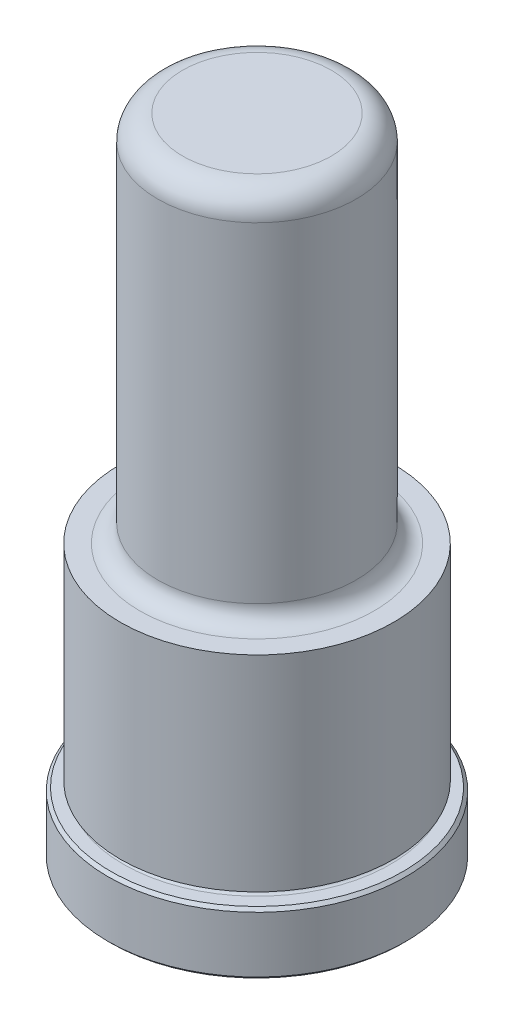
ISO-10303-21;
HEADER;
FILE_DESCRIPTION(('STEP AP214'),'2;1');
FILE_NAME('part.step','',(''),(''),'','','');
FILE_SCHEMA(('AUTOMOTIVE_DESIGN { 1 0 10303 214 1 1 1 1 }'));
ENDSEC;
DATA;
#1=APPLICATION_CONTEXT('core data for automotive mechanical design processes');
#2=APPLICATION_PROTOCOL_DEFINITION('international standard','automotive_design',2000,#1);
#3=PRODUCT_CONTEXT('',#1,'mechanical');
#4=PRODUCT('Part','Part','',(#3));
#5=PRODUCT_RELATED_PRODUCT_CATEGORY('part','',(#4));
#6=PRODUCT_DEFINITION_FORMATION('','',#4);
#7=PRODUCT_DEFINITION_CONTEXT('part definition',#1,'design');
#8=PRODUCT_DEFINITION('design','',#6,#7);
#9=PRODUCT_DEFINITION_SHAPE('','',#8);
#10=(LENGTH_UNIT() NAMED_UNIT(*) SI_UNIT(.MILLI.,.METRE.));
#11=(NAMED_UNIT(*) PLANE_ANGLE_UNIT() SI_UNIT($,.RADIAN.));
#12=(NAMED_UNIT(*) SI_UNIT($,.STERADIAN.) SOLID_ANGLE_UNIT());
#13=UNCERTAINTY_MEASURE_WITH_UNIT(LENGTH_MEASURE(1.E-05),#10,'distance_accuracy_value','');
#14=(GEOMETRIC_REPRESENTATION_CONTEXT(3) GLOBAL_UNCERTAINTY_ASSIGNED_CONTEXT((#13)) GLOBAL_UNIT_ASSIGNED_CONTEXT((#10,
#11,#12)) REPRESENTATION_CONTEXT('',''));
#15=CARTESIAN_POINT('',(0.,0.,0.));
#16=DIRECTION('',(0.,0.,1.));
#17=DIRECTION('',(1.,0.,0.));
#18=AXIS2_PLACEMENT_3D('',#15,#16,#17);
#19=CARTESIAN_POINT('',(0.,0.,0.));
#20=DIRECTION('',(0.,1.,0.));
#21=DIRECTION('',(0.,0.,1.));
#22=AXIS2_PLACEMENT_3D('',#19,#20,#21);
#23=PLANE('',#22);
#24=CARTESIAN_POINT('',(0.,0.,0.));
#25=DIRECTION('',(0.,1.,0.));
#26=DIRECTION('',(0.,0.,1.));
#27=AXIS2_PLACEMENT_3D('',#24,#25,#26);
#28=CIRCLE('',#27,18.669);
#29=CARTESIAN_POINT('',(0.,0.,18.669));
#30=VERTEX_POINT('',#29);
#31=EDGE_CURVE('E46',#30,#30,#28,.F.);
#32=ORIENTED_EDGE('',*,*,#31,.T.);
#33=EDGE_LOOP('',(#32));
#34=FACE_BOUND('',#33,.T.);
#35=ADVANCED_FACE('F31',(#34),#23,.F.);
#36=CARTESIAN_POINT('',(0.,0.,0.));
#37=DIRECTION('',(0.,1.,0.));
#38=DIRECTION('',(0.,0.,1.));
#39=AXIS2_PLACEMENT_3D('',#36,#37,#38);
#40=CYLINDRICAL_SURFACE('',#39,19.05);
#41=CARTESIAN_POINT('',(0.,0.38099999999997,0.));
#42=DIRECTION('',(0.,1.,0.));
#43=DIRECTION('',(0.,0.,1.));
#44=AXIS2_PLACEMENT_3D('',#41,#42,#43);
#45=CIRCLE('',#44,19.05);
#46=CARTESIAN_POINT('',(0.,0.380999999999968,19.05));
#47=VERTEX_POINT('',#46);
#48=EDGE_CURVE('E51',#47,#47,#45,.T.);
#49=ORIENTED_EDGE('',*,*,#48,.T.);
#50=EDGE_LOOP('',(#49));
#51=FACE_BOUND('',#50,.T.);
#52=CARTESIAN_POINT('',(0.,7.5438,0.));
#53=DIRECTION('',(0.,-1.,0.));
#54=DIRECTION('',(0.,0.,-1.));
#55=AXIS2_PLACEMENT_3D('',#52,#53,#54);
#56=CIRCLE('',#55,19.05);
#57=CARTESIAN_POINT('',(0.,7.5438,-19.05));
#58=VERTEX_POINT('',#57);
#59=EDGE_CURVE('E54',#58,#58,#56,.T.);
#60=ORIENTED_EDGE('',*,*,#59,.T.);
#61=EDGE_LOOP('',(#60));
#62=FACE_BOUND('',#61,.T.);
#63=ADVANCED_FACE('F110',(#51,#62),#40,.T.);
#64=CARTESIAN_POINT('',(0.,7.9248,-19.05));
#65=DIRECTION('',(0.,-1.,0.));
#66=DIRECTION('',(0.,0.,-1.));
#67=AXIS2_PLACEMENT_3D('',#64,#65,#66);
#68=PLANE('',#67);
#69=CARTESIAN_POINT('',(0.,7.9248,0.));
#70=DIRECTION('',(0.,-1.,0.));
#71=DIRECTION('',(0.,0.,-1.));
#72=AXIS2_PLACEMENT_3D('',#69,#70,#71);
#73=CIRCLE('',#72,18.669);
#74=CARTESIAN_POINT('',(0.,7.9248,-18.669));
#75=VERTEX_POINT('',#74);
#76=EDGE_CURVE('E42',#75,#75,#73,.F.);
#77=ORIENTED_EDGE('',*,*,#76,.T.);
#78=EDGE_LOOP('',(#77));
#79=FACE_BOUND('',#78,.T.);
#80=CARTESIAN_POINT('',(0.,7.9248,0.));
#81=DIRECTION('',(0.,1.,0.));
#82=DIRECTION('',(0.,0.,1.));
#83=AXIS2_PLACEMENT_3D('',#80,#81,#82);
#84=CIRCLE('',#83,17.0688);
#85=CARTESIAN_POINT('',(0.,7.92479999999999,17.0688));
#86=VERTEX_POINT('',#85);
#87=EDGE_CURVE('E57',#86,#86,#84,.T.);
#88=ORIENTED_EDGE('',*,*,#87,.F.);
#89=EDGE_LOOP('',(#88));
#90=FACE_BOUND('',#89,.T.);
#91=ADVANCED_FACE('F105',(#79,#90),#68,.F.);
#92=CARTESIAN_POINT('',(0.,8.3058,0.));
#93=DIRECTION('',(0.,1.,0.));
#94=DIRECTION('',(0.,0.,1.));
#95=AXIS2_PLACEMENT_3D('',#92,#93,#94);
#96=TOROIDAL_SURFACE('',#95,17.0688,0.381000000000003);
#97=CARTESIAN_POINT('',(0.,8.6868,0.));
#98=DIRECTION('',(0.,1.,0.));
#99=DIRECTION('',(0.,0.,1.));
#100=AXIS2_PLACEMENT_3D('',#97,#98,#99);
#101=CIRCLE('',#100,17.0688);
#102=CARTESIAN_POINT('',(0.,8.6868,17.0688));
#103=VERTEX_POINT('',#102);
#104=EDGE_CURVE('E60',#103,#103,#101,.T.);
#105=ORIENTED_EDGE('',*,*,#104,.F.);
#106=EDGE_LOOP('',(#105));
#107=FACE_BOUND('',#106,.T.);
#108=ORIENTED_EDGE('',*,*,#87,.T.);
#109=EDGE_LOOP('',(#108));
#110=FACE_BOUND('',#109,.T.);
#111=ADVANCED_FACE('F99',(#107,#110),#96,.F.);
#112=CARTESIAN_POINT('',(0.,8.6868,-17.0688));
#113=DIRECTION('',(0.,1.,0.));
#114=DIRECTION('',(0.,0.,1.));
#115=AXIS2_PLACEMENT_3D('',#112,#113,#114);
#116=PLANE('',#115);
#117=CARTESIAN_POINT('',(0.,8.6868,0.));
#118=DIRECTION('',(0.,1.,0.));
#119=DIRECTION('',(0.,0.,1.));
#120=AXIS2_PLACEMENT_3D('',#117,#118,#119);
#121=CIRCLE('',#120,17.4752);
#122=CARTESIAN_POINT('',(0.,8.6868,17.4752));
#123=VERTEX_POINT('',#122);
#124=EDGE_CURVE('E63',#123,#123,#121,.T.);
#125=ORIENTED_EDGE('',*,*,#124,.F.);
#126=EDGE_LOOP('',(#125));
#127=FACE_BOUND('',#126,.T.);
#128=ORIENTED_EDGE('',*,*,#104,.T.);
#129=EDGE_LOOP('',(#128));
#130=FACE_BOUND('',#129,.T.);
#131=ADVANCED_FACE('F93',(#127,#130),#116,.F.);
#132=CARTESIAN_POINT('',(0.,0.,0.));
#133=DIRECTION('',(0.,1.,0.));
#134=DIRECTION('',(0.,0.,1.));
#135=AXIS2_PLACEMENT_3D('',#132,#133,#134);
#136=CYLINDRICAL_SURFACE('',#135,17.4752);
#137=CARTESIAN_POINT('',(0.,34.925,0.));
#138=DIRECTION('',(0.,1.,0.));
#139=DIRECTION('',(0.,0.,1.));
#140=AXIS2_PLACEMENT_3D('',#137,#138,#139);
#141=CIRCLE('',#140,17.4752);
#142=CARTESIAN_POINT('',(0.,34.925,17.4752));
#143=VERTEX_POINT('',#142);
#144=EDGE_CURVE('E66',#143,#143,#141,.T.);
#145=ORIENTED_EDGE('',*,*,#144,.F.);
#146=EDGE_LOOP('',(#145));
#147=FACE_BOUND('',#146,.T.);
#148=ORIENTED_EDGE('',*,*,#124,.T.);
#149=EDGE_LOOP('',(#148));
#150=FACE_BOUND('',#149,.T.);
#151=ADVANCED_FACE('F87',(#147,#150),#136,.T.);
#152=CARTESIAN_POINT('',(0.,34.925,-17.4752));
#153=DIRECTION('',(0.,-1.,0.));
#154=DIRECTION('',(0.,0.,-1.));
#155=AXIS2_PLACEMENT_3D('',#152,#153,#154);
#156=PLANE('',#155);
#157=CARTESIAN_POINT('',(0.,34.925,0.));
#158=DIRECTION('',(0.,1.,0.));
#159=DIRECTION('',(0.,0.,1.));
#160=AXIS2_PLACEMENT_3D('',#157,#158,#159);
#161=CIRCLE('',#160,14.9733);
#162=CARTESIAN_POINT('',(0.,34.925,14.9733));
#163=VERTEX_POINT('',#162);
#164=EDGE_CURVE('E69',#163,#163,#161,.T.);
#165=ORIENTED_EDGE('',*,*,#164,.F.);
#166=EDGE_LOOP('',(#165));
#167=FACE_BOUND('',#166,.T.);
#168=ORIENTED_EDGE('',*,*,#144,.T.);
#169=EDGE_LOOP('',(#168));
#170=FACE_BOUND('',#169,.T.);
#171=ADVANCED_FACE('F81',(#167,#170),#156,.F.);
#172=CARTESIAN_POINT('',(0.,37.211,0.));
#173=DIRECTION('',(0.,1.,0.));
#174=DIRECTION('',(0.,0.,1.));
#175=AXIS2_PLACEMENT_3D('',#172,#173,#174);
#176=TOROIDAL_SURFACE('',#175,14.9733,2.286);
#177=CARTESIAN_POINT('',(0.,37.211,0.));
#178=DIRECTION('',(0.,1.,0.));
#179=DIRECTION('',(0.,0.,1.));
#180=AXIS2_PLACEMENT_3D('',#177,#178,#179);
#181=CIRCLE('',#180,12.6873);
#182=CARTESIAN_POINT('',(0.,37.211,12.6873));
#183=VERTEX_POINT('',#182);
#184=EDGE_CURVE('E72',#183,#183,#181,.T.);
#185=ORIENTED_EDGE('',*,*,#184,.F.);
#186=EDGE_LOOP('',(#185));
#187=FACE_BOUND('',#186,.T.);
#188=ORIENTED_EDGE('',*,*,#164,.T.);
#189=EDGE_LOOP('',(#188));
#190=FACE_BOUND('',#189,.T.);
#191=ADVANCED_FACE('F78',(#187,#190),#176,.F.);
#192=CARTESIAN_POINT('',(0.,0.,0.));
#193=DIRECTION('',(0.,1.,0.));
#194=DIRECTION('',(0.,0.,1.));
#195=AXIS2_PLACEMENT_3D('',#192,#193,#194);
#196=CYLINDRICAL_SURFACE('',#195,12.6873);
#197=CARTESIAN_POINT('',(0.,79.375,0.));
#198=DIRECTION('',(0.,-1.,0.));
#199=DIRECTION('',(0.,0.,-1.));
#200=AXIS2_PLACEMENT_3D('',#197,#198,#199);
#201=CIRCLE('',#200,12.6873);
#202=CARTESIAN_POINT('',(0.,79.375,-12.6873));
#203=VERTEX_POINT('',#202);
#204=EDGE_CURVE('E10',#203,#203,#201,.T.);
#205=ORIENTED_EDGE('',*,*,#204,.T.);
#206=EDGE_LOOP('',(#205));
#207=FACE_BOUND('',#206,.T.);
#208=ORIENTED_EDGE('',*,*,#184,.T.);
#209=EDGE_LOOP('',(#208));
#210=FACE_BOUND('',#209,.T.);
#211=ADVANCED_FACE('F76',(#207,#210),#196,.T.);
#212=CARTESIAN_POINT('',(0.,82.55,-12.6873));
#213=DIRECTION('',(0.,-1.,0.));
#214=DIRECTION('',(0.,0.,-1.));
#215=AXIS2_PLACEMENT_3D('',#212,#213,#214);
#216=PLANE('',#215);
#217=CARTESIAN_POINT('',(0.,82.55,0.));
#218=DIRECTION('',(0.,-1.,0.));
#219=DIRECTION('',(0.,0.,-1.));
#220=AXIS2_PLACEMENT_3D('',#217,#218,#219);
#221=CIRCLE('',#220,9.5123);
#222=CARTESIAN_POINT('',(0.,82.55,-9.51229999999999));
#223=VERTEX_POINT('',#222);
#224=EDGE_CURVE('E38',#223,#223,#221,.F.);
#225=ORIENTED_EDGE('',*,*,#224,.T.);
#226=EDGE_LOOP('',(#225));
#227=FACE_BOUND('',#226,.T.);
#228=ADVANCED_FACE('F127',(#227),#216,.F.);
#229=CARTESIAN_POINT('',(0.,0.38099999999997,0.));
#230=DIRECTION('',(0.,1.,0.));
#231=DIRECTION('',(0.,0.,1.));
#232=AXIS2_PLACEMENT_3D('',#229,#230,#231);
#233=CONICAL_SURFACE('',#232,19.05,0.785398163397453);
#234=ORIENTED_EDGE('',*,*,#31,.F.);
#235=EDGE_LOOP('',(#234));
#236=FACE_BOUND('',#235,.T.);
#237=ORIENTED_EDGE('',*,*,#48,.F.);
#238=EDGE_LOOP('',(#237));
#239=FACE_BOUND('',#238,.T.);
#240=ADVANCED_FACE('F124',(#236,#239),#233,.T.);
#241=CARTESIAN_POINT('',(0.,7.9248,0.));
#242=DIRECTION('',(0.,-1.,0.));
#243=DIRECTION('',(0.,0.,-1.));
#244=AXIS2_PLACEMENT_3D('',#241,#242,#243);
#245=CONICAL_SURFACE('',#244,18.669,0.785398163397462);
#246=ORIENTED_EDGE('',*,*,#59,.F.);
#247=EDGE_LOOP('',(#246));
#248=FACE_BOUND('',#247,.T.);
#249=ORIENTED_EDGE('',*,*,#76,.F.);
#250=EDGE_LOOP('',(#249));
#251=FACE_BOUND('',#250,.T.);
#252=ADVANCED_FACE('F126',(#248,#251),#245,.T.);
#253=CARTESIAN_POINT('',(0.,79.375,0.));
#254=DIRECTION('',(0.,-1.,0.));
#255=DIRECTION('',(0.,0.,-1.));
#256=AXIS2_PLACEMENT_3D('',#253,#254,#255);
#257=TOROIDAL_SURFACE('',#256,9.5123,3.175);
#258=ORIENTED_EDGE('',*,*,#204,.F.);
#259=EDGE_LOOP('',(#258));
#260=FACE_BOUND('',#259,.T.);
#261=ORIENTED_EDGE('',*,*,#224,.F.);
#262=EDGE_LOOP('',(#261));
#263=FACE_BOUND('',#262,.T.);
#264=ADVANCED_FACE('F33',(#260,#263),#257,.T.);
#265=CLOSED_SHELL('',(#35,#63,#91,#111,#131,#151,#171,#191,#211,#228,#240,#252,#264));
#266=MANIFOLD_SOLID_BREP('B2',#265);
#267=ADVANCED_BREP_SHAPE_REPRESENTATION('',(#18,#266),#14);
#268=SHAPE_DEFINITION_REPRESENTATION(#9,#267);
ENDSEC;
END-ISO-10303-21;
